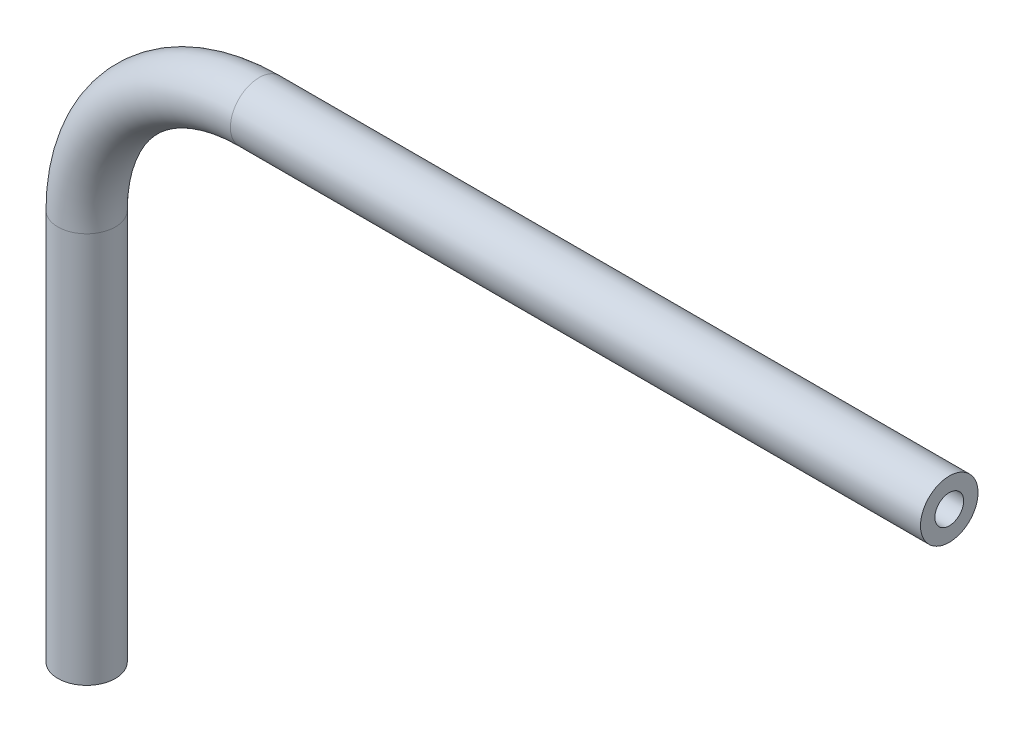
ISO-10303-21;
HEADER;
FILE_DESCRIPTION(('STEP AP214'),'2;1');
FILE_NAME('part.step','',(''),(''),'','','');
FILE_SCHEMA(('AUTOMOTIVE_DESIGN { 1 0 10303 214 1 1 1 1 }'));
ENDSEC;
DATA;
#1=APPLICATION_CONTEXT('core data for automotive mechanical design processes');
#2=APPLICATION_PROTOCOL_DEFINITION('international standard','automotive_design',2000,#1);
#3=PRODUCT_CONTEXT('',#1,'mechanical');
#4=PRODUCT('Part','Part','',(#3));
#5=PRODUCT_RELATED_PRODUCT_CATEGORY('part','',(#4));
#6=PRODUCT_DEFINITION_FORMATION('','',#4);
#7=PRODUCT_DEFINITION_CONTEXT('part definition',#1,'design');
#8=PRODUCT_DEFINITION('design','',#6,#7);
#9=PRODUCT_DEFINITION_SHAPE('','',#8);
#10=(LENGTH_UNIT() NAMED_UNIT(*) SI_UNIT(.MILLI.,.METRE.));
#11=(NAMED_UNIT(*) PLANE_ANGLE_UNIT() SI_UNIT($,.RADIAN.));
#12=(NAMED_UNIT(*) SI_UNIT($,.STERADIAN.) SOLID_ANGLE_UNIT());
#13=UNCERTAINTY_MEASURE_WITH_UNIT(LENGTH_MEASURE(1.E-05),#10,'distance_accuracy_value','');
#14=(GEOMETRIC_REPRESENTATION_CONTEXT(3) GLOBAL_UNCERTAINTY_ASSIGNED_CONTEXT((#13)) GLOBAL_UNIT_ASSIGNED_CONTEXT((#10,
#11,#12)) REPRESENTATION_CONTEXT('',''));
#15=CARTESIAN_POINT('',(0.,0.,0.));
#16=DIRECTION('',(0.,0.,1.));
#17=DIRECTION('',(1.,0.,0.));
#18=AXIS2_PLACEMENT_3D('',#15,#16,#17);
#19=CARTESIAN_POINT('',(0.,0.,0.));
#20=DIRECTION('',(0.,1.,0.));
#21=DIRECTION('',(0.,0.,1.));
#22=AXIS2_PLACEMENT_3D('',#19,#20,#21);
#23=CYLINDRICAL_SURFACE('',#22,1.5875);
#24=CARTESIAN_POINT('',(0.,21.59,0.));
#25=DIRECTION('',(0.,1.,0.));
#26=DIRECTION('',(0.,0.,1.));
#27=AXIS2_PLACEMENT_3D('',#24,#25,#26);
#28=CIRCLE('',#27,1.5875);
#29=CARTESIAN_POINT('',(-1.5875,21.59,0.));
#30=VERTEX_POINT('',#29);
#31=EDGE_CURVE('E81',#30,#30,#28,.T.);
#32=ORIENTED_EDGE('',*,*,#31,.F.);
#33=EDGE_LOOP('',(#32));
#34=FACE_BOUND('',#33,.T.);
#35=CARTESIAN_POINT('',(0.,0.,0.));
#36=DIRECTION('',(0.,1.,0.));
#37=DIRECTION('',(0.,0.,1.));
#38=AXIS2_PLACEMENT_3D('',#35,#36,#37);
#39=CIRCLE('',#38,1.5875);
#40=CARTESIAN_POINT('',(0.,0.,1.5875));
#41=VERTEX_POINT('',#40);
#42=EDGE_CURVE('E50',#41,#41,#39,.T.);
#43=ORIENTED_EDGE('',*,*,#42,.T.);
#44=EDGE_LOOP('',(#43));
#45=FACE_BOUND('',#44,.T.);
#46=ADVANCED_FACE('F35',(#34,#45),#23,.T.);
#47=CARTESIAN_POINT('',(9.525,21.59,0.));
#48=DIRECTION('',(0.,0.,-1.));
#49=DIRECTION('',(-1.,0.,0.));
#50=AXIS2_PLACEMENT_3D('',#47,#48,#49);
#51=TOROIDAL_SURFACE('',#50,9.525,1.5875);
#52=CARTESIAN_POINT('',(9.525,31.115,0.));
#53=DIRECTION('',(1.,0.,0.));
#54=DIRECTION('',(0.,0.,1.));
#55=AXIS2_PLACEMENT_3D('',#52,#53,#54);
#56=CIRCLE('',#55,1.5875);
#57=CARTESIAN_POINT('',(9.525,32.7025,0.));
#58=VERTEX_POINT('',#57);
#59=EDGE_CURVE('E39',#58,#58,#56,.T.);
#60=CARTESIAN_POINT('',(9.525,21.59,0.));
#61=DIRECTION('',(0.,0.,-1.));
#62=DIRECTION('',(-1.,0.,0.));
#63=AXIS2_PLACEMENT_3D('',#60,#61,#62);
#64=CIRCLE('',#63,11.1125);
#65=EDGE_CURVE('',#30,#58,#64,.T.);
#66=ORIENTED_EDGE('',*,*,#31,.T.);
#67=ORIENTED_EDGE('',*,*,#59,.F.);
#68=ORIENTED_EDGE('',*,*,#65,.T.);
#69=ORIENTED_EDGE('',*,*,#65,.F.);
#70=EDGE_LOOP('',(#66,#68,#67,#69));
#71=FACE_BOUND('',#70,.T.);
#72=ADVANCED_FACE('F89',(#71),#51,.T.);
#73=CARTESIAN_POINT('',(9.525,31.115,0.));
#74=DIRECTION('',(1.,0.,0.));
#75=DIRECTION('',(0.,1.,0.));
#76=AXIS2_PLACEMENT_3D('',#73,#74,#75);
#77=CYLINDRICAL_SURFACE('',#76,1.5875);
#78=CARTESIAN_POINT('',(47.625,31.115,0.));
#79=DIRECTION('',(1.,0.,0.));
#80=DIRECTION('',(0.,0.,1.));
#81=AXIS2_PLACEMENT_3D('',#78,#79,#80);
#82=CIRCLE('',#81,1.5875);
#83=CARTESIAN_POINT('',(47.625,31.115,1.5875));
#84=VERTEX_POINT('',#83);
#85=EDGE_CURVE('E55',#84,#84,#82,.T.);
#86=ORIENTED_EDGE('',*,*,#85,.F.);
#87=EDGE_LOOP('',(#86));
#88=FACE_BOUND('',#87,.T.);
#89=ORIENTED_EDGE('',*,*,#59,.T.);
#90=EDGE_LOOP('',(#89));
#91=FACE_BOUND('',#90,.T.);
#92=ADVANCED_FACE('F37',(#88,#91),#77,.T.);
#93=CARTESIAN_POINT('',(0.,0.,0.));
#94=DIRECTION('',(0.,1.,0.));
#95=DIRECTION('',(0.,0.,1.));
#96=AXIS2_PLACEMENT_3D('',#93,#94,#95);
#97=PLANE('',#96);
#98=CARTESIAN_POINT('',(0.,0.,0.));
#99=DIRECTION('',(0.,1.,0.));
#100=DIRECTION('',(0.,0.,1.));
#101=AXIS2_PLACEMENT_3D('',#98,#99,#100);
#102=CIRCLE('',#101,0.79375);
#103=CARTESIAN_POINT('',(0.,0.,0.79375));
#104=VERTEX_POINT('',#103);
#105=EDGE_CURVE('E76',#104,#104,#102,.F.);
#106=ORIENTED_EDGE('',*,*,#105,.F.);
#107=EDGE_LOOP('',(#106));
#108=FACE_BOUND('',#107,.T.);
#109=ORIENTED_EDGE('',*,*,#42,.F.);
#110=EDGE_LOOP('',(#109));
#111=FACE_BOUND('',#110,.T.);
#112=ADVANCED_FACE('F95',(#108,#111),#97,.F.);
#113=CARTESIAN_POINT('',(47.625,31.115,0.));
#114=DIRECTION('',(1.,0.,0.));
#115=DIRECTION('',(0.,0.,1.));
#116=AXIS2_PLACEMENT_3D('',#113,#114,#115);
#117=PLANE('',#116);
#118=CARTESIAN_POINT('',(47.625,31.115,0.));
#119=DIRECTION('',(1.,0.,0.));
#120=DIRECTION('',(0.,0.,1.));
#121=AXIS2_PLACEMENT_3D('',#118,#119,#120);
#122=CIRCLE('',#121,0.79375);
#123=CARTESIAN_POINT('',(47.625,31.115,0.79375));
#124=VERTEX_POINT('',#123);
#125=EDGE_CURVE('E11',#124,#124,#122,.F.);
#126=ORIENTED_EDGE('',*,*,#125,.T.);
#127=EDGE_LOOP('',(#126));
#128=FACE_BOUND('',#127,.T.);
#129=ORIENTED_EDGE('',*,*,#85,.T.);
#130=EDGE_LOOP('',(#129));
#131=FACE_BOUND('',#130,.T.);
#132=ADVANCED_FACE('F62',(#128,#131),#117,.T.);
#133=CARTESIAN_POINT('',(0.,0.,0.));
#134=DIRECTION('',(0.,1.,0.));
#135=DIRECTION('',(0.,0.,1.));
#136=AXIS2_PLACEMENT_3D('',#133,#134,#135);
#137=CYLINDRICAL_SURFACE('',#136,0.79375);
#138=CARTESIAN_POINT('',(0.,21.59,0.));
#139=DIRECTION('',(0.,1.,0.));
#140=DIRECTION('',(0.,0.,1.));
#141=AXIS2_PLACEMENT_3D('',#138,#139,#140);
#142=CIRCLE('',#141,0.79375);
#143=CARTESIAN_POINT('',(-0.793749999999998,21.59,0.));
#144=VERTEX_POINT('',#143);
#145=EDGE_CURVE('E73',#144,#144,#142,.F.);
#146=ORIENTED_EDGE('',*,*,#145,.F.);
#147=EDGE_LOOP('',(#146));
#148=FACE_BOUND('',#147,.T.);
#149=ORIENTED_EDGE('',*,*,#105,.T.);
#150=EDGE_LOOP('',(#149));
#151=FACE_BOUND('',#150,.T.);
#152=ADVANCED_FACE('F103',(#148,#151),#137,.F.);
#153=CARTESIAN_POINT('',(9.525,21.59,0.));
#154=DIRECTION('',(0.,0.,-1.));
#155=DIRECTION('',(-1.,0.,0.));
#156=AXIS2_PLACEMENT_3D('',#153,#154,#155);
#157=TOROIDAL_SURFACE('',#156,9.525,0.79375);
#158=CARTESIAN_POINT('',(9.525,31.115,0.));
#159=DIRECTION('',(1.,0.,0.));
#160=DIRECTION('',(0.,0.,1.));
#161=AXIS2_PLACEMENT_3D('',#158,#159,#160);
#162=CIRCLE('',#161,0.79375);
#163=CARTESIAN_POINT('',(9.525,31.90875,0.));
#164=VERTEX_POINT('',#163);
#165=EDGE_CURVE('E44',#164,#164,#162,.F.);
#166=CARTESIAN_POINT('',(9.525,21.59,0.));
#167=DIRECTION('',(0.,0.,-1.));
#168=DIRECTION('',(-1.,0.,0.));
#169=AXIS2_PLACEMENT_3D('',#166,#167,#168);
#170=CIRCLE('',#169,10.31875);
#171=EDGE_CURVE('',#144,#164,#170,.T.);
#172=ORIENTED_EDGE('',*,*,#145,.T.);
#173=ORIENTED_EDGE('',*,*,#165,.F.);
#174=ORIENTED_EDGE('',*,*,#171,.T.);
#175=ORIENTED_EDGE('',*,*,#171,.F.);
#176=EDGE_LOOP('',(#172,#174,#173,#175));
#177=FACE_BOUND('',#176,.T.);
#178=ADVANCED_FACE('F68',(#177),#157,.F.);
#179=CARTESIAN_POINT('',(9.525,31.115,0.));
#180=DIRECTION('',(1.,0.,0.));
#181=DIRECTION('',(0.,1.,0.));
#182=AXIS2_PLACEMENT_3D('',#179,#180,#181);
#183=CYLINDRICAL_SURFACE('',#182,0.79375);
#184=ORIENTED_EDGE('',*,*,#125,.F.);
#185=EDGE_LOOP('',(#184));
#186=FACE_BOUND('',#185,.T.);
#187=ORIENTED_EDGE('',*,*,#165,.T.);
#188=EDGE_LOOP('',(#187));
#189=FACE_BOUND('',#188,.T.);
#190=ADVANCED_FACE('F65',(#186,#189),#183,.F.);
#191=CLOSED_SHELL('',(#46,#72,#92,#112,#132,#152,#178,#190));
#192=MANIFOLD_SOLID_BREP('B2',#191);
#193=ADVANCED_BREP_SHAPE_REPRESENTATION('',(#18,#192),#14);
#194=SHAPE_DEFINITION_REPRESENTATION(#9,#193);
ENDSEC;
END-ISO-10303-21;
